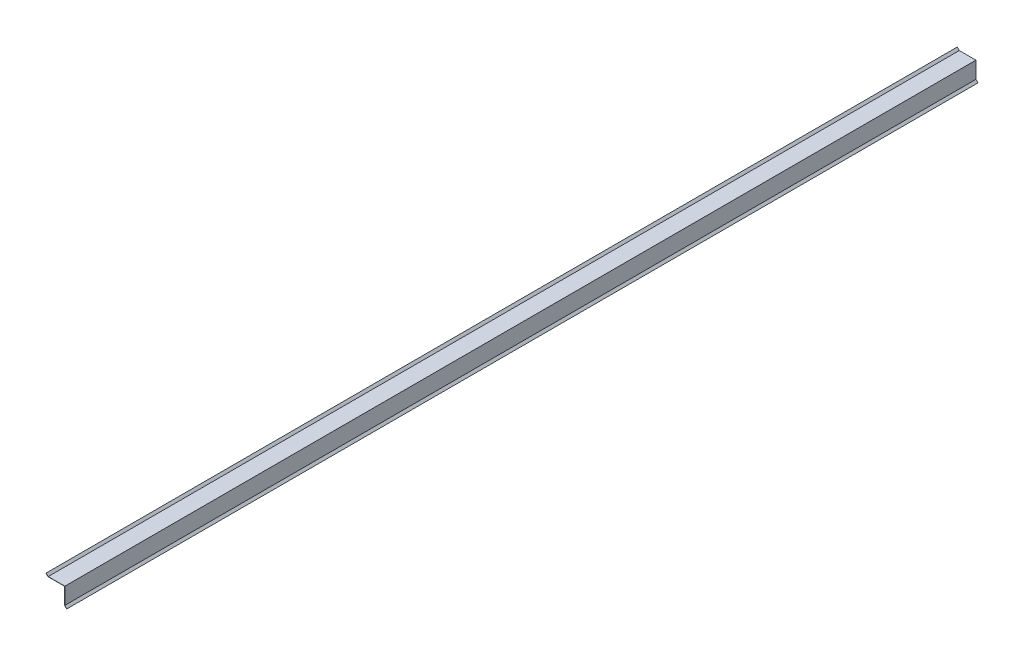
from build123d import *

# Parameters (mm, degrees)
EXTRUDE_THIN1_DEPTH = 2000


with BuildPart() as part:
    # Sketch1 → Extrude-Thin1 (new body)
    with BuildSketch(Plane.XY):
        Polygon((-41.002628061, 4.490128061), (-36.5125, 0), (0, 0), (0, -36.5125), (4.490128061, -41.002628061), (4.130917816, -41.361838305), (-0.508, -36.72292049), (-0.508, -0.508), (-36.72292049, -0.508), (-41.361838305, 4.130917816), align=None)
    extrude(amount=EXTRUDE_THIN1_DEPTH)


solid = part.part
